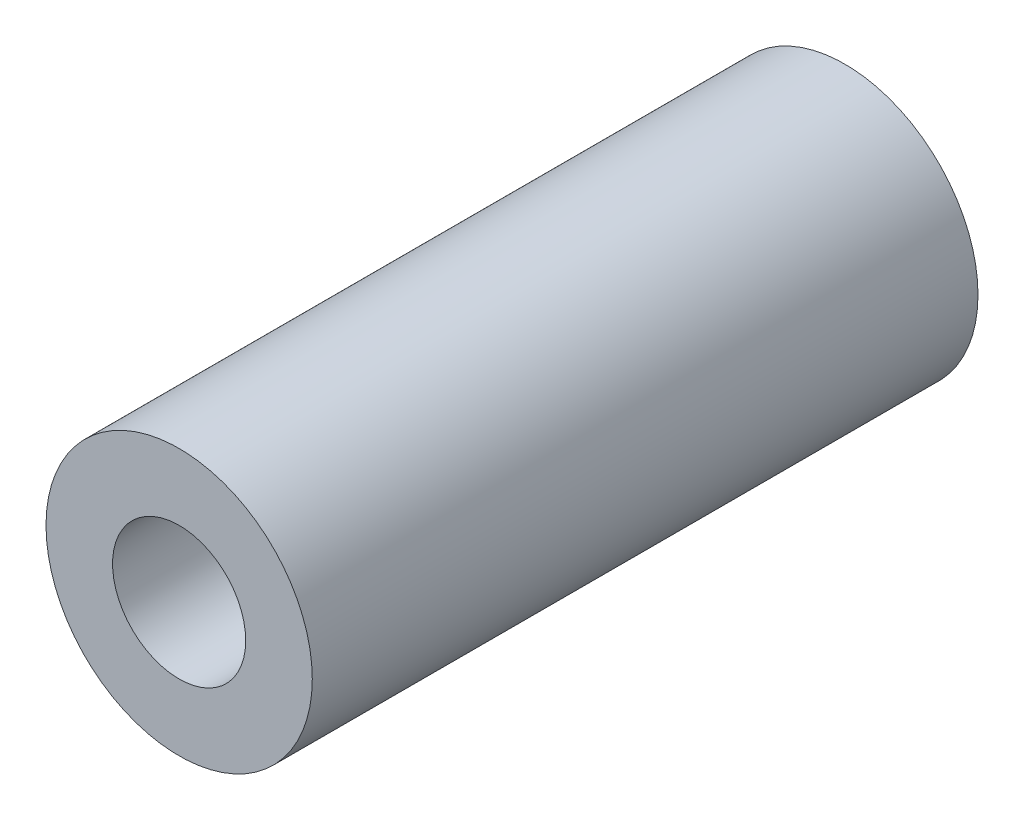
ISO-10303-21;
HEADER;
FILE_DESCRIPTION(('STEP AP214'),'2;1');
FILE_NAME('part.step','',(''),(''),'','','');
FILE_SCHEMA(('AUTOMOTIVE_DESIGN { 1 0 10303 214 1 1 1 1 }'));
ENDSEC;
DATA;
#1=APPLICATION_CONTEXT('core data for automotive mechanical design processes');
#2=APPLICATION_PROTOCOL_DEFINITION('international standard','automotive_design',2000,#1);
#3=PRODUCT_CONTEXT('',#1,'mechanical');
#4=PRODUCT('Part','Part','',(#3));
#5=PRODUCT_RELATED_PRODUCT_CATEGORY('part','',(#4));
#6=PRODUCT_DEFINITION_FORMATION('','',#4);
#7=PRODUCT_DEFINITION_CONTEXT('part definition',#1,'design');
#8=PRODUCT_DEFINITION('design','',#6,#7);
#9=PRODUCT_DEFINITION_SHAPE('','',#8);
#10=(LENGTH_UNIT() NAMED_UNIT(*) SI_UNIT(.MILLI.,.METRE.));
#11=(NAMED_UNIT(*) PLANE_ANGLE_UNIT() SI_UNIT($,.RADIAN.));
#12=(NAMED_UNIT(*) SI_UNIT($,.STERADIAN.) SOLID_ANGLE_UNIT());
#13=UNCERTAINTY_MEASURE_WITH_UNIT(LENGTH_MEASURE(1.E-05),#10,'distance_accuracy_value','');
#14=(GEOMETRIC_REPRESENTATION_CONTEXT(3) GLOBAL_UNCERTAINTY_ASSIGNED_CONTEXT((#13)) GLOBAL_UNIT_ASSIGNED_CONTEXT((#10,
#11,#12)) REPRESENTATION_CONTEXT('',''));
#15=CARTESIAN_POINT('',(0.,0.,0.));
#16=DIRECTION('',(0.,0.,1.));
#17=DIRECTION('',(1.,0.,0.));
#18=AXIS2_PLACEMENT_3D('',#15,#16,#17);
#19=CARTESIAN_POINT('',(10.,0.,22.));
#20=DIRECTION('',(0.,0.,-1.));
#21=DIRECTION('',(-1.,0.,0.));
#22=AXIS2_PLACEMENT_3D('',#19,#20,#21);
#23=PLANE('',#22);
#24=CARTESIAN_POINT('',(0.,0.,22.));
#25=DIRECTION('',(0.,0.,1.));
#26=DIRECTION('',(1.,0.,0.));
#27=AXIS2_PLACEMENT_3D('',#24,#25,#26);
#28=CIRCLE('',#27,7.);
#29=CARTESIAN_POINT('',(7.,0.,22.));
#30=VERTEX_POINT('',#29);
#31=EDGE_CURVE('E8',#30,#30,#28,.T.);
#32=ORIENTED_EDGE('',*,*,#31,.F.);
#33=EDGE_LOOP('',(#32));
#34=FACE_BOUND('',#33,.T.);
#35=CARTESIAN_POINT('',(0.,0.,22.));
#36=DIRECTION('',(0.,0.,1.));
#37=DIRECTION('',(1.,0.,0.));
#38=AXIS2_PLACEMENT_3D('',#35,#36,#37);
#39=CIRCLE('',#38,10.);
#40=CARTESIAN_POINT('',(10.,0.,22.));
#41=VERTEX_POINT('',#40);
#42=EDGE_CURVE('E34',#41,#41,#39,.T.);
#43=ORIENTED_EDGE('',*,*,#42,.T.);
#44=EDGE_LOOP('',(#43));
#45=FACE_BOUND('',#44,.T.);
#46=ADVANCED_FACE('F12',(#34,#45),#23,.F.);
#47=CARTESIAN_POINT('',(0.,0.,40.));
#48=DIRECTION('',(0.,0.,1.));
#49=DIRECTION('',(1.,0.,0.));
#50=AXIS2_PLACEMENT_3D('',#47,#48,#49);
#51=CYLINDRICAL_SURFACE('',#50,7.);
#52=CARTESIAN_POINT('',(0.,0.,0.));
#53=DIRECTION('',(0.,0.,1.));
#54=DIRECTION('',(1.,0.,0.));
#55=AXIS2_PLACEMENT_3D('',#52,#53,#54);
#56=CIRCLE('',#55,7.);
#57=CARTESIAN_POINT('',(7.,0.,0.));
#58=VERTEX_POINT('',#57);
#59=EDGE_CURVE('E18',#58,#58,#56,.T.);
#60=ORIENTED_EDGE('',*,*,#59,.F.);
#61=EDGE_LOOP('',(#60));
#62=FACE_BOUND('',#61,.T.);
#63=ORIENTED_EDGE('',*,*,#31,.T.);
#64=EDGE_LOOP('',(#63));
#65=FACE_BOUND('',#64,.T.);
#66=ADVANCED_FACE('F59',(#62,#65),#51,.F.);
#67=CARTESIAN_POINT('',(7.,0.,0.));
#68=DIRECTION('',(0.,0.,1.));
#69=DIRECTION('',(1.,0.,0.));
#70=AXIS2_PLACEMENT_3D('',#67,#68,#69);
#71=PLANE('',#70);
#72=CARTESIAN_POINT('',(0.,0.,0.));
#73=DIRECTION('',(0.,0.,1.));
#74=DIRECTION('',(1.,0.,0.));
#75=AXIS2_PLACEMENT_3D('',#72,#73,#74);
#76=CIRCLE('',#75,20.);
#77=CARTESIAN_POINT('',(20.,0.,0.));
#78=VERTEX_POINT('',#77);
#79=EDGE_CURVE('E22',#78,#78,#76,.T.);
#80=ORIENTED_EDGE('',*,*,#79,.F.);
#81=EDGE_LOOP('',(#80));
#82=FACE_BOUND('',#81,.T.);
#83=ORIENTED_EDGE('',*,*,#59,.T.);
#84=EDGE_LOOP('',(#83));
#85=FACE_BOUND('',#84,.T.);
#86=ADVANCED_FACE('F54',(#82,#85),#71,.F.);
#87=CARTESIAN_POINT('',(0.,0.,40.));
#88=DIRECTION('',(0.,0.,1.));
#89=DIRECTION('',(1.,0.,0.));
#90=AXIS2_PLACEMENT_3D('',#87,#88,#89);
#91=CYLINDRICAL_SURFACE('',#90,20.);
#92=CARTESIAN_POINT('',(0.,0.,100.));
#93=DIRECTION('',(0.,0.,1.));
#94=DIRECTION('',(1.,0.,0.));
#95=AXIS2_PLACEMENT_3D('',#92,#93,#94);
#96=CIRCLE('',#95,20.);
#97=CARTESIAN_POINT('',(20.,0.,100.));
#98=VERTEX_POINT('',#97);
#99=EDGE_CURVE('E26',#98,#98,#96,.T.);
#100=ORIENTED_EDGE('',*,*,#99,.F.);
#101=EDGE_LOOP('',(#100));
#102=FACE_BOUND('',#101,.T.);
#103=ORIENTED_EDGE('',*,*,#79,.T.);
#104=EDGE_LOOP('',(#103));
#105=FACE_BOUND('',#104,.T.);
#106=ADVANCED_FACE('F48',(#102,#105),#91,.T.);
#107=CARTESIAN_POINT('',(20.,0.,100.));
#108=DIRECTION('',(0.,0.,-1.));
#109=DIRECTION('',(-1.,0.,0.));
#110=AXIS2_PLACEMENT_3D('',#107,#108,#109);
#111=PLANE('',#110);
#112=CARTESIAN_POINT('',(0.,0.,100.));
#113=DIRECTION('',(0.,0.,1.));
#114=DIRECTION('',(1.,0.,0.));
#115=AXIS2_PLACEMENT_3D('',#112,#113,#114);
#116=CIRCLE('',#115,10.);
#117=CARTESIAN_POINT('',(10.,0.,100.));
#118=VERTEX_POINT('',#117);
#119=EDGE_CURVE('E31',#118,#118,#116,.T.);
#120=ORIENTED_EDGE('',*,*,#119,.F.);
#121=EDGE_LOOP('',(#120));
#122=FACE_BOUND('',#121,.T.);
#123=ORIENTED_EDGE('',*,*,#99,.T.);
#124=EDGE_LOOP('',(#123));
#125=FACE_BOUND('',#124,.T.);
#126=ADVANCED_FACE('F42',(#122,#125),#111,.F.);
#127=CARTESIAN_POINT('',(0.,0.,40.));
#128=DIRECTION('',(0.,0.,1.));
#129=DIRECTION('',(1.,0.,0.));
#130=AXIS2_PLACEMENT_3D('',#127,#128,#129);
#131=CYLINDRICAL_SURFACE('',#130,10.);
#132=ORIENTED_EDGE('',*,*,#42,.F.);
#133=EDGE_LOOP('',(#132));
#134=FACE_BOUND('',#133,.T.);
#135=ORIENTED_EDGE('',*,*,#119,.T.);
#136=EDGE_LOOP('',(#135));
#137=FACE_BOUND('',#136,.T.);
#138=ADVANCED_FACE('F39',(#134,#137),#131,.F.);
#139=CLOSED_SHELL('',(#46,#66,#86,#106,#126,#138));
#140=MANIFOLD_SOLID_BREP('B1',#139);
#141=ADVANCED_BREP_SHAPE_REPRESENTATION('',(#18,#140),#14);
#142=SHAPE_DEFINITION_REPRESENTATION(#9,#141);
ENDSEC;
END-ISO-10303-21;
